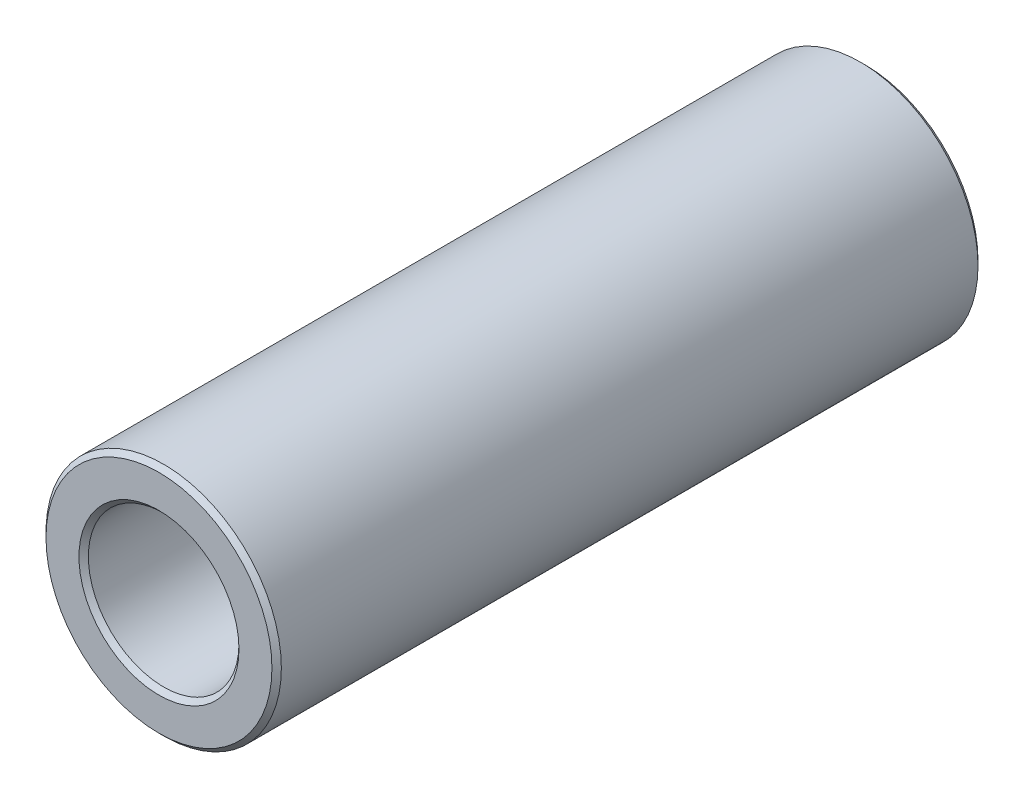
from build123d import *

# Parameters (mm, degrees)
SKETCH1_R           = 5
SKETCH1_R_2         = 3.2
BOSS_EXTRUDE2_DEPTH = 15
CHAMFER3_SIZE       = 0.2


with BuildPart() as part:
    # Sketch1 → Boss-Extrude2 (new, symmetric)
    with BuildSketch(Plane.XY):
        Circle(SKETCH1_R)
        Circle(SKETCH1_R_2, mode=Mode.SUBTRACT)
    extrude(amount=BOSS_EXTRUDE2_DEPTH, both=True)

    # Chamfer3
    chamfer3_edges = [part.edges().sort_by_distance(p)[0] for p in [
        (-5, 0, -15),
        (-5, 0, 15),
        (-3.2, 0, -15),
        (-3.2, 0, 15),
    ]]
    chamfer(chamfer3_edges, length=CHAMFER3_SIZE)


solid = part.part
